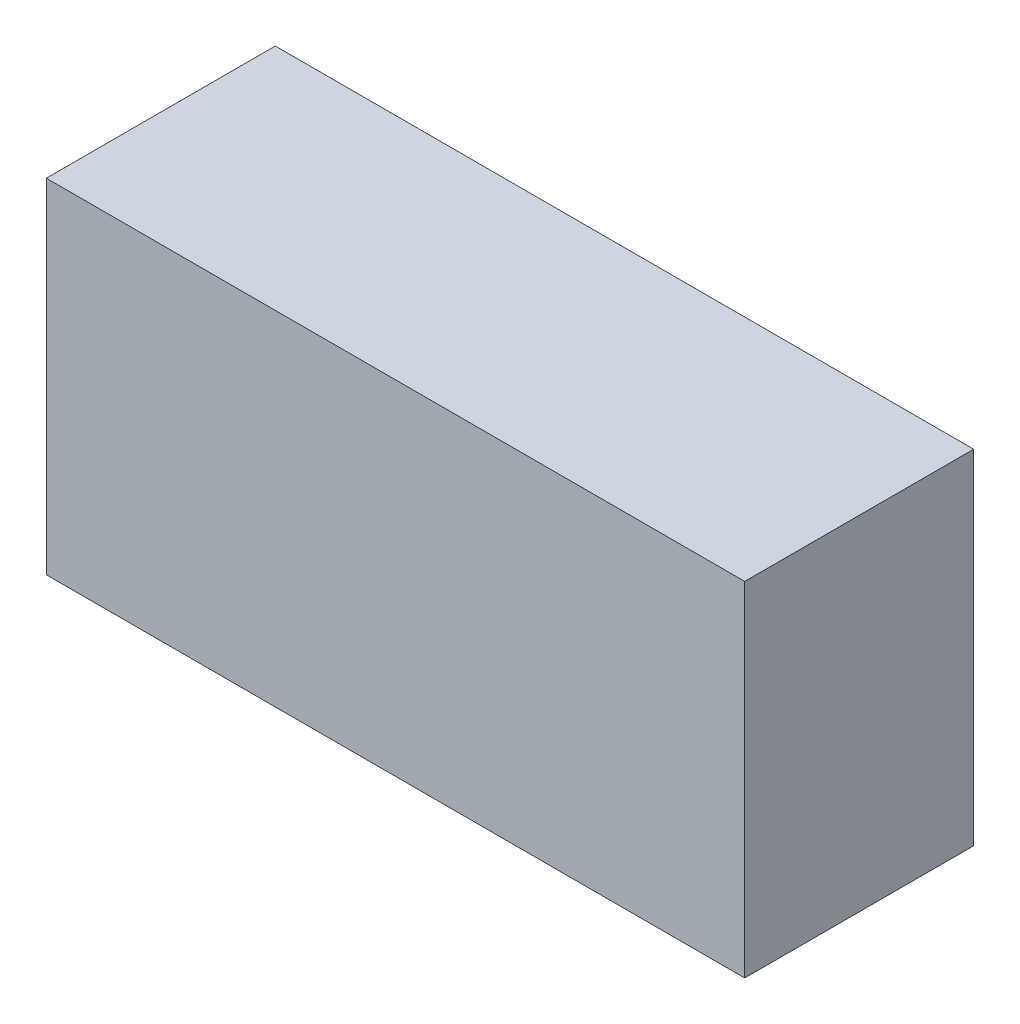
ISO-10303-21;
HEADER;
FILE_DESCRIPTION(('STEP AP214'),'2;1');
FILE_NAME('part.step','',(''),(''),'','','');
FILE_SCHEMA(('AUTOMOTIVE_DESIGN { 1 0 10303 214 1 1 1 1 }'));
ENDSEC;
DATA;
#1=APPLICATION_CONTEXT('core data for automotive mechanical design processes');
#2=APPLICATION_PROTOCOL_DEFINITION('international standard','automotive_design',2000,#1);
#3=PRODUCT_CONTEXT('',#1,'mechanical');
#4=PRODUCT('Part','Part','',(#3));
#5=PRODUCT_RELATED_PRODUCT_CATEGORY('part','',(#4));
#6=PRODUCT_DEFINITION_FORMATION('','',#4);
#7=PRODUCT_DEFINITION_CONTEXT('part definition',#1,'design');
#8=PRODUCT_DEFINITION('design','',#6,#7);
#9=PRODUCT_DEFINITION_SHAPE('','',#8);
#10=(LENGTH_UNIT() NAMED_UNIT(*) SI_UNIT(.MILLI.,.METRE.));
#11=(NAMED_UNIT(*) PLANE_ANGLE_UNIT() SI_UNIT($,.RADIAN.));
#12=(NAMED_UNIT(*) SI_UNIT($,.STERADIAN.) SOLID_ANGLE_UNIT());
#13=UNCERTAINTY_MEASURE_WITH_UNIT(LENGTH_MEASURE(1.E-05),#10,'distance_accuracy_value','');
#14=(GEOMETRIC_REPRESENTATION_CONTEXT(3) GLOBAL_UNCERTAINTY_ASSIGNED_CONTEXT((#13)) GLOBAL_UNIT_ASSIGNED_CONTEXT((#10,
#11,#12)) REPRESENTATION_CONTEXT('',''));
#15=CARTESIAN_POINT('',(0.,0.,0.));
#16=DIRECTION('',(0.,0.,1.));
#17=DIRECTION('',(1.,0.,0.));
#18=AXIS2_PLACEMENT_3D('',#15,#16,#17);
#19=CARTESIAN_POINT('',(-1.52500000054,0.75000000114,0.99999999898));
#20=DIRECTION('',(1.,0.,0.));
#21=DIRECTION('',(0.,0.,-1.));
#22=AXIS2_PLACEMENT_3D('',#19,#20,#21);
#23=PLANE('',#22);
#24=DIRECTION('',(0.,-1.,0.));
#25=VECTOR('',#24,1.);
#26=CARTESIAN_POINT('',(-1.52500000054,0.75000000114,0.));
#27=LINE('',#26,#25);
#28=CARTESIAN_POINT('',(-1.52500000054,0.75000000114,0.));
#29=VERTEX_POINT('',#28);
#30=CARTESIAN_POINT('',(-1.52500000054,-0.75000000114,0.));
#31=VERTEX_POINT('',#30);
#32=EDGE_CURVE('E96',#29,#31,#27,.T.);
#33=ORIENTED_EDGE('',*,*,#32,.T.);
#34=DIRECTION('',(0.,0.,-1.));
#35=VECTOR('',#34,1.);
#36=CARTESIAN_POINT('',(-1.52500000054,-0.75000000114,0.99999999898));
#37=LINE('',#36,#35);
#38=CARTESIAN_POINT('',(-1.52500000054,-0.75000000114,0.99999999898));
#39=VERTEX_POINT('',#38);
#40=EDGE_CURVE('E11',#39,#31,#37,.T.);
#41=ORIENTED_EDGE('',*,*,#40,.F.);
#42=DIRECTION('',(0.,-1.,0.));
#43=VECTOR('',#42,1.);
#44=CARTESIAN_POINT('',(-1.52500000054,0.75000000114,0.99999999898));
#45=LINE('',#44,#43);
#46=CARTESIAN_POINT('',(-1.52500000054,0.75000000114,0.99999999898));
#47=VERTEX_POINT('',#46);
#48=EDGE_CURVE('E84',#47,#39,#45,.T.);
#49=ORIENTED_EDGE('',*,*,#48,.F.);
#50=DIRECTION('',(0.,0.,-1.));
#51=VECTOR('',#50,1.);
#52=CARTESIAN_POINT('',(-1.52500000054,0.75000000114,0.99999999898));
#53=LINE('',#52,#51);
#54=EDGE_CURVE('E92',#47,#29,#53,.T.);
#55=ORIENTED_EDGE('',*,*,#54,.T.);
#56=EDGE_LOOP('',(#33,#41,#49,#55));
#57=FACE_BOUND('',#56,.T.);
#58=ADVANCED_FACE('F33',(#57),#23,.F.);
#59=CARTESIAN_POINT('',(-1.52500000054,-0.75000000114,0.99999999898));
#60=DIRECTION('',(0.,1.,0.));
#61=DIRECTION('',(0.,0.,1.));
#62=AXIS2_PLACEMENT_3D('',#59,#60,#61);
#63=PLANE('',#62);
#64=DIRECTION('',(1.,0.,0.));
#65=VECTOR('',#64,1.);
#66=CARTESIAN_POINT('',(-1.52500000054,-0.75000000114,0.));
#67=LINE('',#66,#65);
#68=CARTESIAN_POINT('',(1.52500000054,-0.75000000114,0.));
#69=VERTEX_POINT('',#68);
#70=EDGE_CURVE('E88',#31,#69,#67,.T.);
#71=ORIENTED_EDGE('',*,*,#70,.T.);
#72=DIRECTION('',(0.,0.,-1.));
#73=VECTOR('',#72,1.);
#74=CARTESIAN_POINT('',(1.52500000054,-0.75000000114,0.99999999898));
#75=LINE('',#74,#73);
#76=CARTESIAN_POINT('',(1.52500000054,-0.75000000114,0.99999999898));
#77=VERTEX_POINT('',#76);
#78=EDGE_CURVE('E41',#77,#69,#75,.T.);
#79=ORIENTED_EDGE('',*,*,#78,.F.);
#80=DIRECTION('',(1.,0.,0.));
#81=VECTOR('',#80,1.);
#82=CARTESIAN_POINT('',(-1.52500000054,-0.75000000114,0.99999999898));
#83=LINE('',#82,#81);
#84=EDGE_CURVE('E79',#39,#77,#83,.T.);
#85=ORIENTED_EDGE('',*,*,#84,.F.);
#86=ORIENTED_EDGE('',*,*,#40,.T.);
#87=EDGE_LOOP('',(#71,#79,#85,#86));
#88=FACE_BOUND('',#87,.T.);
#89=ADVANCED_FACE('F87',(#88),#63,.F.);
#90=CARTESIAN_POINT('',(1.52500000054,-0.75000000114,0.99999999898));
#91=DIRECTION('',(-1.,0.,0.));
#92=DIRECTION('',(0.,0.,1.));
#93=AXIS2_PLACEMENT_3D('',#90,#91,#92);
#94=PLANE('',#93);
#95=DIRECTION('',(0.,1.,0.));
#96=VECTOR('',#95,1.);
#97=CARTESIAN_POINT('',(1.52500000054,-0.75000000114,0.));
#98=LINE('',#97,#96);
#99=CARTESIAN_POINT('',(1.52500000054,0.75000000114,0.));
#100=VERTEX_POINT('',#99);
#101=EDGE_CURVE('E66',#69,#100,#98,.T.);
#102=ORIENTED_EDGE('',*,*,#101,.T.);
#103=DIRECTION('',(0.,0.,-1.));
#104=VECTOR('',#103,1.);
#105=CARTESIAN_POINT('',(1.52500000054,0.75000000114,0.99999999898));
#106=LINE('',#105,#104);
#107=CARTESIAN_POINT('',(1.52500000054,0.75000000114,0.99999999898));
#108=VERTEX_POINT('',#107);
#109=EDGE_CURVE('E89',#108,#100,#106,.T.);
#110=ORIENTED_EDGE('',*,*,#109,.F.);
#111=DIRECTION('',(0.,1.,0.));
#112=VECTOR('',#111,1.);
#113=CARTESIAN_POINT('',(1.52500000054,-0.75000000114,0.99999999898));
#114=LINE('',#113,#112);
#115=EDGE_CURVE('E82',#77,#108,#114,.T.);
#116=ORIENTED_EDGE('',*,*,#115,.F.);
#117=ORIENTED_EDGE('',*,*,#78,.T.);
#118=EDGE_LOOP('',(#102,#110,#116,#117));
#119=FACE_BOUND('',#118,.T.);
#120=ADVANCED_FACE('F90',(#119),#94,.F.);
#121=CARTESIAN_POINT('',(1.52500000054,0.75000000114,0.99999999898));
#122=DIRECTION('',(0.,-1.,0.));
#123=DIRECTION('',(0.,0.,-1.));
#124=AXIS2_PLACEMENT_3D('',#121,#122,#123);
#125=PLANE('',#124);
#126=DIRECTION('',(-1.,0.,0.));
#127=VECTOR('',#126,1.);
#128=CARTESIAN_POINT('',(1.52500000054,0.75000000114,0.));
#129=LINE('',#128,#127);
#130=EDGE_CURVE('E72',#100,#29,#129,.T.);
#131=ORIENTED_EDGE('',*,*,#130,.T.);
#132=ORIENTED_EDGE('',*,*,#54,.F.);
#133=DIRECTION('',(-1.,0.,0.));
#134=VECTOR('',#133,1.);
#135=CARTESIAN_POINT('',(1.52500000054,0.75000000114,0.99999999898));
#136=LINE('',#135,#134);
#137=EDGE_CURVE('E49',#108,#47,#136,.T.);
#138=ORIENTED_EDGE('',*,*,#137,.F.);
#139=ORIENTED_EDGE('',*,*,#109,.T.);
#140=EDGE_LOOP('',(#131,#132,#138,#139));
#141=FACE_BOUND('',#140,.T.);
#142=ADVANCED_FACE('F103',(#141),#125,.F.);
#143=CARTESIAN_POINT('',(0.,0.,0.99999999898));
#144=DIRECTION('',(0.,0.,1.));
#145=DIRECTION('',(1.,0.,0.));
#146=AXIS2_PLACEMENT_3D('',#143,#144,#145);
#147=PLANE('',#146);
#148=ORIENTED_EDGE('',*,*,#48,.T.);
#149=ORIENTED_EDGE('',*,*,#84,.T.);
#150=ORIENTED_EDGE('',*,*,#115,.T.);
#151=ORIENTED_EDGE('',*,*,#137,.T.);
#152=EDGE_LOOP('',(#148,#149,#150,#151));
#153=FACE_BOUND('',#152,.T.);
#154=ADVANCED_FACE('F80',(#153),#147,.T.);
#155=CARTESIAN_POINT('',(0.,0.,0.));
#156=DIRECTION('',(0.,0.,1.));
#157=DIRECTION('',(1.,0.,0.));
#158=AXIS2_PLACEMENT_3D('',#155,#156,#157);
#159=PLANE('',#158);
#160=ORIENTED_EDGE('',*,*,#32,.F.);
#161=ORIENTED_EDGE('',*,*,#130,.F.);
#162=ORIENTED_EDGE('',*,*,#101,.F.);
#163=ORIENTED_EDGE('',*,*,#70,.F.);
#164=EDGE_LOOP('',(#160,#161,#162,#163));
#165=FACE_BOUND('',#164,.T.);
#166=ADVANCED_FACE('F106',(#165),#159,.F.);
#167=CLOSED_SHELL('',(#58,#89,#120,#142,#154,#166));
#168=MANIFOLD_SOLID_BREP('B2',#167);
#169=ADVANCED_BREP_SHAPE_REPRESENTATION('',(#18,#168),#14);
#170=SHAPE_DEFINITION_REPRESENTATION(#9,#169);
ENDSEC;
END-ISO-10303-21;
